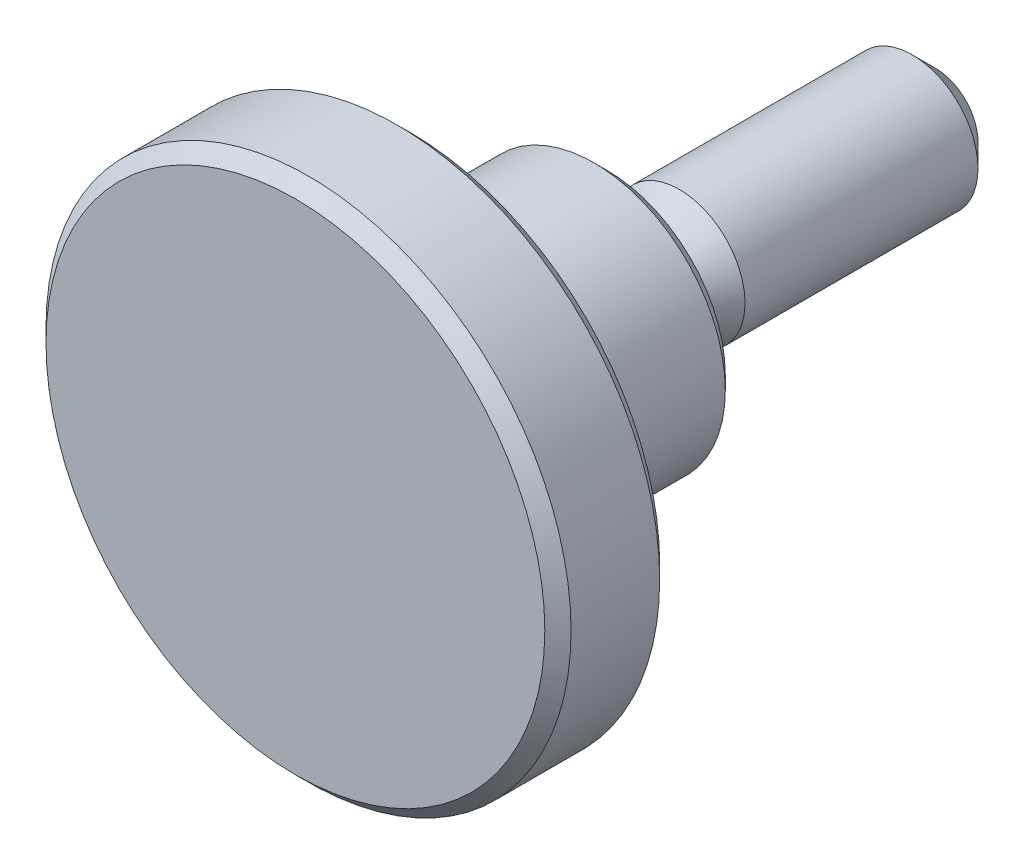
ISO-10303-21;
HEADER;
FILE_DESCRIPTION(('STEP AP214'),'2;1');
FILE_NAME('part.step','',(''),(''),'','','');
FILE_SCHEMA(('AUTOMOTIVE_DESIGN { 1 0 10303 214 1 1 1 1 }'));
ENDSEC;
DATA;
#1=APPLICATION_CONTEXT('core data for automotive mechanical design processes');
#2=APPLICATION_PROTOCOL_DEFINITION('international standard','automotive_design',2000,#1);
#3=PRODUCT_CONTEXT('',#1,'mechanical');
#4=PRODUCT('Part','Part','',(#3));
#5=PRODUCT_RELATED_PRODUCT_CATEGORY('part','',(#4));
#6=PRODUCT_DEFINITION_FORMATION('','',#4);
#7=PRODUCT_DEFINITION_CONTEXT('part definition',#1,'design');
#8=PRODUCT_DEFINITION('design','',#6,#7);
#9=PRODUCT_DEFINITION_SHAPE('','',#8);
#10=(LENGTH_UNIT() NAMED_UNIT(*) SI_UNIT(.MILLI.,.METRE.));
#11=(NAMED_UNIT(*) PLANE_ANGLE_UNIT() SI_UNIT($,.RADIAN.));
#12=(NAMED_UNIT(*) SI_UNIT($,.STERADIAN.) SOLID_ANGLE_UNIT());
#13=UNCERTAINTY_MEASURE_WITH_UNIT(LENGTH_MEASURE(1.E-05),#10,'distance_accuracy_value','');
#14=(GEOMETRIC_REPRESENTATION_CONTEXT(3) GLOBAL_UNCERTAINTY_ASSIGNED_CONTEXT((#13)) GLOBAL_UNIT_ASSIGNED_CONTEXT((#10,
#11,#12)) REPRESENTATION_CONTEXT('',''));
#15=CARTESIAN_POINT('',(0.,0.,0.));
#16=DIRECTION('',(0.,0.,1.));
#17=DIRECTION('',(1.,0.,0.));
#18=AXIS2_PLACEMENT_3D('',#15,#16,#17);
#19=CARTESIAN_POINT('',(0.,0.,-9.99999999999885));
#20=DIRECTION('',(0.,0.,1.));
#21=DIRECTION('',(1.,0.,0.));
#22=AXIS2_PLACEMENT_3D('',#19,#20,#21);
#23=PLANE('',#22);
#24=CARTESIAN_POINT('',(0.,0.,-9.99999999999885));
#25=DIRECTION('',(0.,0.,1.));
#26=DIRECTION('',(1.,0.,0.));
#27=AXIS2_PLACEMENT_3D('',#24,#25,#26);
#28=CIRCLE('',#27,1.30000383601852);
#29=CARTESIAN_POINT('',(1.30000383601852,0.,-9.99999999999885));
#30=VERTEX_POINT('',#29);
#31=EDGE_CURVE('E8',#30,#30,#28,.T.);
#32=ORIENTED_EDGE('',*,*,#31,.F.);
#33=EDGE_LOOP('',(#32));
#34=FACE_BOUND('',#33,.T.);
#35=ADVANCED_FACE('F12',(#34),#23,.F.);
#36=CARTESIAN_POINT('',(0.,0.,-9.99999999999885));
#37=DIRECTION('',(0.,0.,1.));
#38=DIRECTION('',(1.,0.,0.));
#39=AXIS2_PLACEMENT_3D('',#36,#37,#38);
#40=CONICAL_SURFACE('',#39,1.30000383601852,0.78539816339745);
#41=CARTESIAN_POINT('',(0.,0.,-9.29999999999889));
#42=DIRECTION('',(0.,0.,1.));
#43=DIRECTION('',(1.,0.,0.));
#44=AXIS2_PLACEMENT_3D('',#41,#42,#43);
#45=CIRCLE('',#44,2.00000383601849);
#46=CARTESIAN_POINT('',(2.00000383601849,0.,-9.29999999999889));
#47=VERTEX_POINT('',#46);
#48=EDGE_CURVE('E18',#47,#47,#45,.T.);
#49=ORIENTED_EDGE('',*,*,#48,.F.);
#50=EDGE_LOOP('',(#49));
#51=FACE_BOUND('',#50,.T.);
#52=ORIENTED_EDGE('',*,*,#31,.T.);
#53=EDGE_LOOP('',(#52));
#54=FACE_BOUND('',#53,.T.);
#55=ADVANCED_FACE('F132',(#51,#54),#40,.T.);
#56=CARTESIAN_POINT('',(0.,0.,12.));
#57=DIRECTION('',(0.,0.,1.));
#58=DIRECTION('',(1.,0.,0.));
#59=AXIS2_PLACEMENT_3D('',#56,#57,#58);
#60=CYLINDRICAL_SURFACE('',#59,2.00000383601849);
#61=CARTESIAN_POINT('',(0.,0.,-2.19999999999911));
#62=DIRECTION('',(0.,0.,1.));
#63=DIRECTION('',(1.,0.,0.));
#64=AXIS2_PLACEMENT_3D('',#61,#62,#63);
#65=CIRCLE('',#64,2.00000383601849);
#66=CARTESIAN_POINT('',(2.00000383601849,0.,-2.19999999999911));
#67=VERTEX_POINT('',#66);
#68=EDGE_CURVE('E22',#67,#67,#65,.T.);
#69=ORIENTED_EDGE('',*,*,#68,.F.);
#70=EDGE_LOOP('',(#69));
#71=FACE_BOUND('',#70,.T.);
#72=ORIENTED_EDGE('',*,*,#48,.T.);
#73=EDGE_LOOP('',(#72));
#74=FACE_BOUND('',#73,.T.);
#75=ADVANCED_FACE('F127',(#71,#74),#60,.T.);
#76=CARTESIAN_POINT('',(0.,0.,-2.19999999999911));
#77=DIRECTION('',(0.,0.,-1.));
#78=DIRECTION('',(-1.,0.,0.));
#79=AXIS2_PLACEMENT_3D('',#76,#77,#78);
#80=CONICAL_SURFACE('',#79,2.00000383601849,0.523598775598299);
#81=CARTESIAN_POINT('',(0.,0.,-1.33396795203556));
#82=DIRECTION('',(0.,0.,1.));
#83=DIRECTION('',(1.,0.,0.));
#84=AXIS2_PLACEMENT_3D('',#81,#82,#83);
#85=CIRCLE('',#84,1.49999999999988);
#86=CARTESIAN_POINT('',(1.49999999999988,0.,-1.33396795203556));
#87=VERTEX_POINT('',#86);
#88=EDGE_CURVE('E26',#87,#87,#85,.T.);
#89=ORIENTED_EDGE('',*,*,#88,.F.);
#90=EDGE_LOOP('',(#89));
#91=FACE_BOUND('',#90,.T.);
#92=ORIENTED_EDGE('',*,*,#68,.T.);
#93=EDGE_LOOP('',(#92));
#94=FACE_BOUND('',#93,.T.);
#95=ADVANCED_FACE('F121',(#91,#94),#80,.T.);
#96=CARTESIAN_POINT('',(0.,0.,12.));
#97=DIRECTION('',(0.,0.,1.));
#98=DIRECTION('',(1.,0.,0.));
#99=AXIS2_PLACEMENT_3D('',#96,#97,#98);
#100=CYLINDRICAL_SURFACE('',#99,1.49999999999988);
#101=CARTESIAN_POINT('',(0.,0.,-0.399999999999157));
#102=DIRECTION('',(0.,0.,1.));
#103=DIRECTION('',(1.,0.,0.));
#104=AXIS2_PLACEMENT_3D('',#101,#102,#103);
#105=CIRCLE('',#104,1.49999999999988);
#106=CARTESIAN_POINT('',(1.49999999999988,0.,-0.399999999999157));
#107=VERTEX_POINT('',#106);
#108=EDGE_CURVE('E31',#107,#107,#105,.T.);
#109=ORIENTED_EDGE('',*,*,#108,.F.);
#110=EDGE_LOOP('',(#109));
#111=FACE_BOUND('',#110,.T.);
#112=ORIENTED_EDGE('',*,*,#88,.T.);
#113=EDGE_LOOP('',(#112));
#114=FACE_BOUND('',#113,.T.);
#115=ADVANCED_FACE('F115',(#111,#114),#100,.T.);
#116=CARTESIAN_POINT('',(0.,0.,-0.399999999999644));
#117=DIRECTION('',(0.,0.,1.));
#118=DIRECTION('',(1.,0.,0.));
#119=AXIS2_PLACEMENT_3D('',#116,#117,#118);
#120=TOROIDAL_SURFACE('',#119,1.89999999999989,0.400000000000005);
#121=CARTESIAN_POINT('',(0.,0.,3.60822483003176E-13));
#122=DIRECTION('',(0.,0.,1.));
#123=DIRECTION('',(1.,0.,0.));
#124=AXIS2_PLACEMENT_3D('',#121,#122,#123);
#125=CIRCLE('',#124,1.89999999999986);
#126=CARTESIAN_POINT('',(1.89999999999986,0.,3.60822483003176E-13));
#127=VERTEX_POINT('',#126);
#128=EDGE_CURVE('E34',#127,#127,#125,.T.);
#129=ORIENTED_EDGE('',*,*,#128,.F.);
#130=EDGE_LOOP('',(#129));
#131=FACE_BOUND('',#130,.T.);
#132=ORIENTED_EDGE('',*,*,#108,.T.);
#133=EDGE_LOOP('',(#132));
#134=FACE_BOUND('',#133,.T.);
#135=ADVANCED_FACE('F109',(#131,#134),#120,.F.);
#136=CARTESIAN_POINT('',(0.,1.89999999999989,3.60872132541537E-13));
#137=DIRECTION('',(0.,0.,1.));
#138=DIRECTION('',(1.,0.,0.));
#139=AXIS2_PLACEMENT_3D('',#136,#137,#138);
#140=PLANE('',#139);
#141=CARTESIAN_POINT('',(0.,0.,3.60822483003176E-13));
#142=DIRECTION('',(0.,0.,1.));
#143=DIRECTION('',(1.,0.,0.));
#144=AXIS2_PLACEMENT_3D('',#141,#142,#143);
#145=CIRCLE('',#144,3.59999999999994);
#146=CARTESIAN_POINT('',(3.59999999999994,0.,3.60822483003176E-13));
#147=VERTEX_POINT('',#146);
#148=EDGE_CURVE('E37',#147,#147,#145,.T.);
#149=ORIENTED_EDGE('',*,*,#148,.F.);
#150=EDGE_LOOP('',(#149));
#151=FACE_BOUND('',#150,.T.);
#152=ORIENTED_EDGE('',*,*,#128,.T.);
#153=EDGE_LOOP('',(#152));
#154=FACE_BOUND('',#153,.T.);
#155=ADVANCED_FACE('F103',(#151,#154),#140,.F.);
#156=CARTESIAN_POINT('',(0.,0.,3.60822483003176E-13));
#157=DIRECTION('',(0.,0.,1.));
#158=DIRECTION('',(1.,0.,0.));
#159=AXIS2_PLACEMENT_3D('',#156,#157,#158);
#160=CONICAL_SURFACE('',#159,3.59999999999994,0.785398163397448);
#161=CARTESIAN_POINT('',(0.,0.,0.400000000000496));
#162=DIRECTION('',(0.,0.,1.));
#163=DIRECTION('',(1.,0.,0.));
#164=AXIS2_PLACEMENT_3D('',#161,#162,#163);
#165=CIRCLE('',#164,4.00000000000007);
#166=CARTESIAN_POINT('',(4.00000000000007,0.,0.400000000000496));
#167=VERTEX_POINT('',#166);
#168=EDGE_CURVE('E40',#167,#167,#165,.T.);
#169=ORIENTED_EDGE('',*,*,#168,.F.);
#170=EDGE_LOOP('',(#169));
#171=FACE_BOUND('',#170,.T.);
#172=ORIENTED_EDGE('',*,*,#148,.T.);
#173=EDGE_LOOP('',(#172));
#174=FACE_BOUND('',#173,.T.);
#175=ADVANCED_FACE('F97',(#171,#174),#160,.T.);
#176=CARTESIAN_POINT('',(0.,0.,12.));
#177=DIRECTION('',(0.,0.,1.));
#178=DIRECTION('',(1.,0.,0.));
#179=AXIS2_PLACEMENT_3D('',#176,#177,#178);
#180=CYLINDRICAL_SURFACE('',#179,4.00000000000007);
#181=CARTESIAN_POINT('',(0.,0.,5.50000000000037));
#182=DIRECTION('',(0.,0.,1.));
#183=DIRECTION('',(1.,0.,0.));
#184=AXIS2_PLACEMENT_3D('',#181,#182,#183);
#185=CIRCLE('',#184,4.00000000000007);
#186=CARTESIAN_POINT('',(4.00000000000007,0.,5.50000000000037));
#187=VERTEX_POINT('',#186);
#188=EDGE_CURVE('E43',#187,#187,#185,.T.);
#189=ORIENTED_EDGE('',*,*,#188,.F.);
#190=EDGE_LOOP('',(#189));
#191=FACE_BOUND('',#190,.T.);
#192=ORIENTED_EDGE('',*,*,#168,.T.);
#193=EDGE_LOOP('',(#192));
#194=FACE_BOUND('',#193,.T.);
#195=ADVANCED_FACE('F91',(#191,#194),#180,.T.);
#196=CARTESIAN_POINT('',(0.,0.,5.5));
#197=DIRECTION('',(0.,0.,1.));
#198=DIRECTION('',(1.,0.,0.));
#199=AXIS2_PLACEMENT_3D('',#196,#197,#198);
#200=TOROIDAL_SURFACE('',#199,4.50000000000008,0.5);
#201=CARTESIAN_POINT('',(0.,0.,6.));
#202=DIRECTION('',(0.,0.,1.));
#203=DIRECTION('',(1.,0.,0.));
#204=AXIS2_PLACEMENT_3D('',#201,#202,#203);
#205=CIRCLE('',#204,4.50000000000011);
#206=CARTESIAN_POINT('',(4.50000000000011,0.,6.));
#207=VERTEX_POINT('',#206);
#208=EDGE_CURVE('E46',#207,#207,#205,.T.);
#209=ORIENTED_EDGE('',*,*,#208,.F.);
#210=EDGE_LOOP('',(#209));
#211=FACE_BOUND('',#210,.T.);
#212=ORIENTED_EDGE('',*,*,#188,.T.);
#213=EDGE_LOOP('',(#212));
#214=FACE_BOUND('',#213,.T.);
#215=ADVANCED_FACE('F85',(#211,#214),#200,.F.);
#216=CARTESIAN_POINT('',(0.,4.50000000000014,6.));
#217=DIRECTION('',(0.,0.,1.));
#218=DIRECTION('',(1.,0.,0.));
#219=AXIS2_PLACEMENT_3D('',#216,#217,#218);
#220=PLANE('',#219);
#221=CARTESIAN_POINT('',(0.,0.,6.));
#222=DIRECTION('',(0.,0.,1.));
#223=DIRECTION('',(1.,0.,0.));
#224=AXIS2_PLACEMENT_3D('',#221,#222,#223);
#225=CIRCLE('',#224,7.6000000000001);
#226=CARTESIAN_POINT('',(7.6000000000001,0.,6.));
#227=VERTEX_POINT('',#226);
#228=EDGE_CURVE('E49',#227,#227,#225,.T.);
#229=ORIENTED_EDGE('',*,*,#228,.F.);
#230=EDGE_LOOP('',(#229));
#231=FACE_BOUND('',#230,.T.);
#232=ORIENTED_EDGE('',*,*,#208,.T.);
#233=EDGE_LOOP('',(#232));
#234=FACE_BOUND('',#233,.T.);
#235=ADVANCED_FACE('F79',(#231,#234),#220,.F.);
#236=CARTESIAN_POINT('',(0.,0.,6.));
#237=DIRECTION('',(0.,0.,1.));
#238=DIRECTION('',(1.,0.,0.));
#239=AXIS2_PLACEMENT_3D('',#236,#237,#238);
#240=CONICAL_SURFACE('',#239,7.6000000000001,0.785398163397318);
#241=CARTESIAN_POINT('',(0.,0.,6.4));
#242=DIRECTION('',(0.,0.,1.));
#243=DIRECTION('',(1.,0.,0.));
#244=AXIS2_PLACEMENT_3D('',#241,#242,#243);
#245=CIRCLE('',#244,8.);
#246=CARTESIAN_POINT('',(8.,0.,6.4));
#247=VERTEX_POINT('',#246);
#248=EDGE_CURVE('E52',#247,#247,#245,.T.);
#249=ORIENTED_EDGE('',*,*,#248,.F.);
#250=EDGE_LOOP('',(#249));
#251=FACE_BOUND('',#250,.T.);
#252=ORIENTED_EDGE('',*,*,#228,.T.);
#253=EDGE_LOOP('',(#252));
#254=FACE_BOUND('',#253,.T.);
#255=ADVANCED_FACE('F73',(#251,#254),#240,.T.);
#256=CARTESIAN_POINT('',(0.,0.,12.));
#257=DIRECTION('',(0.,0.,1.));
#258=DIRECTION('',(1.,0.,0.));
#259=AXIS2_PLACEMENT_3D('',#256,#257,#258);
#260=CYLINDRICAL_SURFACE('',#259,8.);
#261=CARTESIAN_POINT('',(0.,0.,9.1));
#262=DIRECTION('',(0.,0.,1.));
#263=DIRECTION('',(1.,0.,0.));
#264=AXIS2_PLACEMENT_3D('',#261,#262,#263);
#265=CIRCLE('',#264,8.);
#266=CARTESIAN_POINT('',(8.,0.,9.1));
#267=VERTEX_POINT('',#266);
#268=EDGE_CURVE('E55',#267,#267,#265,.T.);
#269=ORIENTED_EDGE('',*,*,#268,.F.);
#270=EDGE_LOOP('',(#269));
#271=FACE_BOUND('',#270,.T.);
#272=ORIENTED_EDGE('',*,*,#248,.T.);
#273=EDGE_LOOP('',(#272));
#274=FACE_BOUND('',#273,.T.);
#275=ADVANCED_FACE('F67',(#271,#274),#260,.T.);
#276=CARTESIAN_POINT('',(0.,0.,9.1));
#277=DIRECTION('',(0.,0.,-1.));
#278=DIRECTION('',(-1.,0.,0.));
#279=AXIS2_PLACEMENT_3D('',#276,#277,#278);
#280=CONICAL_SURFACE('',#279,8.,0.785398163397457);
#281=CARTESIAN_POINT('',(0.,0.,9.5));
#282=DIRECTION('',(0.,0.,1.));
#283=DIRECTION('',(1.,0.,0.));
#284=AXIS2_PLACEMENT_3D('',#281,#282,#283);
#285=CIRCLE('',#284,7.6);
#286=CARTESIAN_POINT('',(7.6,0.,9.5));
#287=VERTEX_POINT('',#286);
#288=EDGE_CURVE('E58',#287,#287,#285,.T.);
#289=ORIENTED_EDGE('',*,*,#288,.F.);
#290=EDGE_LOOP('',(#289));
#291=FACE_BOUND('',#290,.T.);
#292=ORIENTED_EDGE('',*,*,#268,.T.);
#293=EDGE_LOOP('',(#292));
#294=FACE_BOUND('',#293,.T.);
#295=ADVANCED_FACE('F64',(#291,#294),#280,.T.);
#296=CARTESIAN_POINT('',(0.,0.,9.5));
#297=DIRECTION('',(0.,0.,-1.));
#298=DIRECTION('',(-1.,0.,0.));
#299=AXIS2_PLACEMENT_3D('',#296,#297,#298);
#300=PLANE('',#299);
#301=ORIENTED_EDGE('',*,*,#288,.T.);
#302=EDGE_LOOP('',(#301));
#303=FACE_BOUND('',#302,.T.);
#304=ADVANCED_FACE('F62',(#303),#300,.F.);
#305=CLOSED_SHELL('',(#35,#55,#75,#95,#115,#135,#155,#175,#195,#215,#235,#255,#275,#295,#304));
#306=MANIFOLD_SOLID_BREP('B1',#305);
#307=ADVANCED_BREP_SHAPE_REPRESENTATION('',(#18,#306),#14);
#308=SHAPE_DEFINITION_REPRESENTATION(#9,#307);
ENDSEC;
END-ISO-10303-21;
